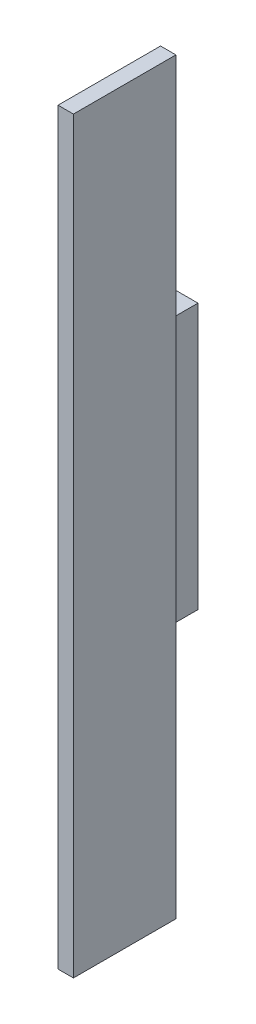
ISO-10303-21;
HEADER;
FILE_DESCRIPTION(('STEP AP214'),'2;1');
FILE_NAME('part.step','',(''),(''),'','','');
FILE_SCHEMA(('AUTOMOTIVE_DESIGN { 1 0 10303 214 1 1 1 1 }'));
ENDSEC;
DATA;
#1=APPLICATION_CONTEXT('core data for automotive mechanical design processes');
#2=APPLICATION_PROTOCOL_DEFINITION('international standard','automotive_design',2000,#1);
#3=PRODUCT_CONTEXT('',#1,'mechanical');
#4=PRODUCT('Part','Part','',(#3));
#5=PRODUCT_RELATED_PRODUCT_CATEGORY('part','',(#4));
#6=PRODUCT_DEFINITION_FORMATION('','',#4);
#7=PRODUCT_DEFINITION_CONTEXT('part definition',#1,'design');
#8=PRODUCT_DEFINITION('design','',#6,#7);
#9=PRODUCT_DEFINITION_SHAPE('','',#8);
#10=(LENGTH_UNIT() NAMED_UNIT(*) SI_UNIT(.MILLI.,.METRE.));
#11=(NAMED_UNIT(*) PLANE_ANGLE_UNIT() SI_UNIT($,.RADIAN.));
#12=(NAMED_UNIT(*) SI_UNIT($,.STERADIAN.) SOLID_ANGLE_UNIT());
#13=UNCERTAINTY_MEASURE_WITH_UNIT(LENGTH_MEASURE(1.E-05),#10,'distance_accuracy_value','');
#14=(GEOMETRIC_REPRESENTATION_CONTEXT(3) GLOBAL_UNCERTAINTY_ASSIGNED_CONTEXT((#13)) GLOBAL_UNIT_ASSIGNED_CONTEXT((#10,
#11,#12)) REPRESENTATION_CONTEXT('',''));
#15=CARTESIAN_POINT('',(0.,0.,0.));
#16=DIRECTION('',(0.,0.,1.));
#17=DIRECTION('',(1.,0.,0.));
#18=AXIS2_PLACEMENT_3D('',#15,#16,#17);
#19=CARTESIAN_POINT('',(3.,73.,20.));
#20=DIRECTION('',(0.,0.,-1.));
#21=DIRECTION('',(0.,1.,0.));
#22=AXIS2_PLACEMENT_3D('',#19,#20,#21);
#23=PLANE('',#22);
#24=DIRECTION('',(0.,-1.,0.));
#25=VECTOR('',#24,1.);
#26=CARTESIAN_POINT('',(0.,73.,20.));
#27=LINE('',#26,#25);
#28=CARTESIAN_POINT('',(0.,73.,20.));
#29=VERTEX_POINT('',#28);
#30=CARTESIAN_POINT('',(0.,-73.,20.));
#31=VERTEX_POINT('',#30);
#32=EDGE_CURVE('E155',#29,#31,#27,.T.);
#33=ORIENTED_EDGE('',*,*,#32,.T.);
#34=DIRECTION('',(-1.,0.,0.));
#35=VECTOR('',#34,1.);
#36=CARTESIAN_POINT('',(3.,-73.,20.));
#37=LINE('',#36,#35);
#38=CARTESIAN_POINT('',(3.,-73.,20.));
#39=VERTEX_POINT('',#38);
#40=EDGE_CURVE('E9',#39,#31,#37,.T.);
#41=ORIENTED_EDGE('',*,*,#40,.F.);
#42=DIRECTION('',(0.,-1.,0.));
#43=VECTOR('',#42,1.);
#44=CARTESIAN_POINT('',(3.,73.,20.));
#45=LINE('',#44,#43);
#46=CARTESIAN_POINT('',(3.,73.,20.));
#47=VERTEX_POINT('',#46);
#48=EDGE_CURVE('E196',#47,#39,#45,.T.);
#49=ORIENTED_EDGE('',*,*,#48,.F.);
#50=DIRECTION('',(-1.,0.,0.));
#51=VECTOR('',#50,1.);
#52=CARTESIAN_POINT('',(3.,73.,20.));
#53=LINE('',#52,#51);
#54=EDGE_CURVE('E193',#47,#29,#53,.T.);
#55=ORIENTED_EDGE('',*,*,#54,.T.);
#56=EDGE_LOOP('',(#33,#41,#49,#55));
#57=FACE_BOUND('',#56,.T.);
#58=ADVANCED_FACE('F14',(#57),#23,.F.);
#59=CARTESIAN_POINT('',(3.,-73.,20.));
#60=DIRECTION('',(0.,1.,0.));
#61=DIRECTION('',(-1.,0.,0.));
#62=AXIS2_PLACEMENT_3D('',#59,#60,#61);
#63=PLANE('',#62);
#64=DIRECTION('',(0.,0.,-1.));
#65=VECTOR('',#64,1.);
#66=CARTESIAN_POINT('',(0.,-73.,20.));
#67=LINE('',#66,#65);
#68=CARTESIAN_POINT('',(0.,-73.,0.));
#69=VERTEX_POINT('',#68);
#70=EDGE_CURVE('E165',#31,#69,#67,.T.);
#71=ORIENTED_EDGE('',*,*,#70,.T.);
#72=DIRECTION('',(-1.,0.,0.));
#73=VECTOR('',#72,1.);
#74=CARTESIAN_POINT('',(3.,-73.,0.));
#75=LINE('',#74,#73);
#76=CARTESIAN_POINT('',(3.,-73.,0.));
#77=VERTEX_POINT('',#76);
#78=EDGE_CURVE('E23',#77,#69,#75,.T.);
#79=ORIENTED_EDGE('',*,*,#78,.F.);
#80=DIRECTION('',(0.,0.,-1.));
#81=VECTOR('',#80,1.);
#82=CARTESIAN_POINT('',(3.,-73.,20.));
#83=LINE('',#82,#81);
#84=EDGE_CURVE('E197',#39,#77,#83,.T.);
#85=ORIENTED_EDGE('',*,*,#84,.F.);
#86=ORIENTED_EDGE('',*,*,#40,.T.);
#87=EDGE_LOOP('',(#71,#79,#85,#86));
#88=FACE_BOUND('',#87,.T.);
#89=ADVANCED_FACE('F208',(#88),#63,.F.);
#90=CARTESIAN_POINT('',(3.,-73.,0.));
#91=DIRECTION('',(0.,0.,1.));
#92=DIRECTION('',(1.,0.,0.));
#93=AXIS2_PLACEMENT_3D('',#90,#91,#92);
#94=PLANE('',#93);
#95=DIRECTION('',(0.,1.,0.));
#96=VECTOR('',#95,1.);
#97=CARTESIAN_POINT('',(0.,-73.,0.));
#98=LINE('',#97,#96);
#99=CARTESIAN_POINT('',(0.,-35.,0.));
#100=VERTEX_POINT('',#99);
#101=EDGE_CURVE('E178',#69,#100,#98,.T.);
#102=ORIENTED_EDGE('',*,*,#101,.T.);
#103=DIRECTION('',(1.,0.,0.));
#104=VECTOR('',#103,1.);
#105=CARTESIAN_POINT('',(-6.,-35.,0.));
#106=LINE('',#105,#104);
#107=CARTESIAN_POINT('',(-6.,-35.,0.));
#108=VERTEX_POINT('',#107);
#109=EDGE_CURVE('E112',#108,#100,#106,.T.);
#110=ORIENTED_EDGE('',*,*,#109,.F.);
#111=DIRECTION('',(0.,1.,0.));
#112=VECTOR('',#111,1.);
#113=CARTESIAN_POINT('',(-6.,-35.,0.));
#114=LINE('',#113,#112);
#115=CARTESIAN_POINT('',(-6.,-25.9,0.));
#116=VERTEX_POINT('',#115);
#117=EDGE_CURVE('E136',#108,#116,#114,.T.);
#118=ORIENTED_EDGE('',*,*,#117,.T.);
#119=DIRECTION('',(1.,0.,0.));
#120=VECTOR('',#119,1.);
#121=CARTESIAN_POINT('',(-6.,-25.9,0.));
#122=LINE('',#121,#120);
#123=CARTESIAN_POINT('',(0.,-25.9,0.));
#124=VERTEX_POINT('',#123);
#125=EDGE_CURVE('E161',#116,#124,#122,.T.);
#126=ORIENTED_EDGE('',*,*,#125,.T.);
#127=CARTESIAN_POINT('',(0.,25.9,0.));
#128=VERTEX_POINT('',#127);
#129=EDGE_CURVE('E179',#124,#128,#98,.T.);
#130=ORIENTED_EDGE('',*,*,#129,.T.);
#131=DIRECTION('',(1.,0.,0.));
#132=VECTOR('',#131,1.);
#133=CARTESIAN_POINT('',(-6.,25.9,0.));
#134=LINE('',#133,#132);
#135=CARTESIAN_POINT('',(-6.,25.9,0.));
#136=VERTEX_POINT('',#135);
#137=EDGE_CURVE('E159',#136,#128,#134,.T.);
#138=ORIENTED_EDGE('',*,*,#137,.F.);
#139=DIRECTION('',(0.,1.,0.));
#140=VECTOR('',#139,1.);
#141=CARTESIAN_POINT('',(-6.,25.9,0.));
#142=LINE('',#141,#140);
#143=CARTESIAN_POINT('',(-6.,34.9999999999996,0.));
#144=VERTEX_POINT('',#143);
#145=EDGE_CURVE('E148',#136,#144,#142,.T.);
#146=ORIENTED_EDGE('',*,*,#145,.T.);
#147=DIRECTION('',(1.,0.,0.));
#148=VECTOR('',#147,1.);
#149=CARTESIAN_POINT('',(-6.,34.9999999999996,0.));
#150=LINE('',#149,#148);
#151=CARTESIAN_POINT('',(0.,34.9999999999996,0.));
#152=VERTEX_POINT('',#151);
#153=EDGE_CURVE('E156',#144,#152,#150,.T.);
#154=ORIENTED_EDGE('',*,*,#153,.T.);
#155=CARTESIAN_POINT('',(0.,73.,0.));
#156=VERTEX_POINT('',#155);
#157=EDGE_CURVE('E167',#152,#156,#98,.T.);
#158=ORIENTED_EDGE('',*,*,#157,.T.);
#159=DIRECTION('',(-1.,0.,0.));
#160=VECTOR('',#159,1.);
#161=CARTESIAN_POINT('',(3.,73.,0.));
#162=LINE('',#161,#160);
#163=CARTESIAN_POINT('',(3.,73.,0.));
#164=VERTEX_POINT('',#163);
#165=EDGE_CURVE('E188',#164,#156,#162,.T.);
#166=ORIENTED_EDGE('',*,*,#165,.F.);
#167=DIRECTION('',(0.,1.,0.));
#168=VECTOR('',#167,1.);
#169=CARTESIAN_POINT('',(3.,-73.,0.));
#170=LINE('',#169,#168);
#171=EDGE_CURVE('E200',#77,#164,#170,.T.);
#172=ORIENTED_EDGE('',*,*,#171,.F.);
#173=ORIENTED_EDGE('',*,*,#78,.T.);
#174=EDGE_LOOP('',(#102,#110,#118,#126,#130,#138,#146,#154,#158,#166,#172,#173));
#175=FACE_BOUND('',#174,.T.);
#176=ADVANCED_FACE('F186',(#175),#94,.F.);
#177=CARTESIAN_POINT('',(3.,73.,0.));
#178=DIRECTION('',(0.,-1.,0.));
#179=DIRECTION('',(1.,0.,0.));
#180=AXIS2_PLACEMENT_3D('',#177,#178,#179);
#181=PLANE('',#180);
#182=DIRECTION('',(0.,0.,1.));
#183=VECTOR('',#182,1.);
#184=CARTESIAN_POINT('',(0.,73.,0.));
#185=LINE('',#184,#183);
#186=EDGE_CURVE('E170',#156,#29,#185,.T.);
#187=ORIENTED_EDGE('',*,*,#186,.T.);
#188=ORIENTED_EDGE('',*,*,#54,.F.);
#189=DIRECTION('',(0.,0.,1.));
#190=VECTOR('',#189,1.);
#191=CARTESIAN_POINT('',(3.,73.,0.));
#192=LINE('',#191,#190);
#193=EDGE_CURVE('E39',#164,#47,#192,.T.);
#194=ORIENTED_EDGE('',*,*,#193,.F.);
#195=ORIENTED_EDGE('',*,*,#165,.T.);
#196=EDGE_LOOP('',(#187,#188,#194,#195));
#197=FACE_BOUND('',#196,.T.);
#198=ADVANCED_FACE('F191',(#197),#181,.F.);
#199=CARTESIAN_POINT('',(3.,-73.,20.));
#200=DIRECTION('',(1.,0.,0.));
#201=DIRECTION('',(0.,1.,0.));
#202=AXIS2_PLACEMENT_3D('',#199,#200,#201);
#203=PLANE('',#202);
#204=ORIENTED_EDGE('',*,*,#48,.T.);
#205=ORIENTED_EDGE('',*,*,#84,.T.);
#206=ORIENTED_EDGE('',*,*,#171,.T.);
#207=ORIENTED_EDGE('',*,*,#193,.T.);
#208=EDGE_LOOP('',(#204,#205,#206,#207));
#209=FACE_BOUND('',#208,.T.);
#210=ADVANCED_FACE('F224',(#209),#203,.T.);
#211=CARTESIAN_POINT('',(0.,-73.,20.));
#212=DIRECTION('',(1.,0.,0.));
#213=DIRECTION('',(0.,1.,0.));
#214=AXIS2_PLACEMENT_3D('',#211,#212,#213);
#215=PLANE('',#214);
#216=DIRECTION('',(0.,-1.,0.));
#217=VECTOR('',#216,1.);
#218=CARTESIAN_POINT('',(0.,-35.,7.69999999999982));
#219=LINE('',#218,#217);
#220=CARTESIAN_POINT('',(0.,35.,7.69999999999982));
#221=VERTEX_POINT('',#220);
#222=CARTESIAN_POINT('',(0.,-35.,7.69999999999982));
#223=VERTEX_POINT('',#222);
#224=EDGE_CURVE('E31',#221,#223,#219,.T.);
#225=ORIENTED_EDGE('',*,*,#224,.T.);
#226=DIRECTION('',(0.,0.,-1.));
#227=VECTOR('',#226,1.);
#228=CARTESIAN_POINT('',(0.,-35.,0.));
#229=LINE('',#228,#227);
#230=EDGE_CURVE('E17',#223,#100,#229,.T.);
#231=ORIENTED_EDGE('',*,*,#230,.T.);
#232=ORIENTED_EDGE('',*,*,#101,.F.);
#233=ORIENTED_EDGE('',*,*,#70,.F.);
#234=ORIENTED_EDGE('',*,*,#32,.F.);
#235=ORIENTED_EDGE('',*,*,#186,.F.);
#236=ORIENTED_EDGE('',*,*,#157,.F.);
#237=DIRECTION('',(0.,0.,1.));
#238=VECTOR('',#237,1.);
#239=CARTESIAN_POINT('',(0.,35.,7.69999999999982));
#240=LINE('',#239,#238);
#241=EDGE_CURVE('E125',#152,#221,#240,.T.);
#242=ORIENTED_EDGE('',*,*,#241,.T.);
#243=EDGE_LOOP('',(#225,#231,#232,#233,#234,#235,#236,#242));
#244=FACE_BOUND('',#243,.T.);
#245=ADVANCED_FACE('F122',(#244),#215,.F.);
#246=CARTESIAN_POINT('',(0.,25.9,7.69999999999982));
#247=DIRECTION('',(1.,0.,0.));
#248=DIRECTION('',(0.,1.,0.));
#249=AXIS2_PLACEMENT_3D('',#246,#247,#248);
#250=PLANE('',#249);
#251=ORIENTED_EDGE('',*,*,#129,.F.);
#252=DIRECTION('',(0.,0.,-1.));
#253=VECTOR('',#252,1.);
#254=CARTESIAN_POINT('',(0.,-25.9,0.));
#255=LINE('',#254,#253);
#256=CARTESIAN_POINT('',(0.,-25.9,-7.30000000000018));
#257=VERTEX_POINT('',#256);
#258=EDGE_CURVE('E120',#124,#257,#255,.T.);
#259=ORIENTED_EDGE('',*,*,#258,.T.);
#260=DIRECTION('',(0.,1.,0.));
#261=VECTOR('',#260,1.);
#262=CARTESIAN_POINT('',(0.,-25.9,-7.30000000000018));
#263=LINE('',#262,#261);
#264=CARTESIAN_POINT('',(0.,25.9,-7.30000000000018));
#265=VERTEX_POINT('',#264);
#266=EDGE_CURVE('E129',#257,#265,#263,.T.);
#267=ORIENTED_EDGE('',*,*,#266,.T.);
#268=DIRECTION('',(0.,0.,1.));
#269=VECTOR('',#268,1.);
#270=CARTESIAN_POINT('',(0.,25.9,-7.30000000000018));
#271=LINE('',#270,#269);
#272=EDGE_CURVE('E132',#265,#128,#271,.T.);
#273=ORIENTED_EDGE('',*,*,#272,.T.);
#274=EDGE_LOOP('',(#251,#259,#267,#273));
#275=FACE_BOUND('',#274,.T.);
#276=ADVANCED_FACE('F229',(#275),#250,.T.);
#277=CARTESIAN_POINT('',(-6.,-35.,7.69999999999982));
#278=DIRECTION('',(0.,0.,1.));
#279=DIRECTION('',(1.,0.,0.));
#280=AXIS2_PLACEMENT_3D('',#277,#278,#279);
#281=PLANE('',#280);
#282=ORIENTED_EDGE('',*,*,#224,.F.);
#283=DIRECTION('',(1.,0.,0.));
#284=VECTOR('',#283,1.);
#285=CARTESIAN_POINT('',(-6.,35.,7.69999999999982));
#286=LINE('',#285,#284);
#287=CARTESIAN_POINT('',(-6.,35.,7.69999999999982));
#288=VERTEX_POINT('',#287);
#289=EDGE_CURVE('E153',#288,#221,#286,.T.);
#290=ORIENTED_EDGE('',*,*,#289,.F.);
#291=DIRECTION('',(0.,-1.,0.));
#292=VECTOR('',#291,1.);
#293=CARTESIAN_POINT('',(-6.,-35.,7.69999999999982));
#294=LINE('',#293,#292);
#295=CARTESIAN_POINT('',(-6.,-35.,7.69999999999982));
#296=VERTEX_POINT('',#295);
#297=EDGE_CURVE('E108',#288,#296,#294,.T.);
#298=ORIENTED_EDGE('',*,*,#297,.T.);
#299=DIRECTION('',(1.,0.,0.));
#300=VECTOR('',#299,1.);
#301=CARTESIAN_POINT('',(-6.,-35.,7.69999999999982));
#302=LINE('',#301,#300);
#303=EDGE_CURVE('E104',#296,#223,#302,.T.);
#304=ORIENTED_EDGE('',*,*,#303,.T.);
#305=EDGE_LOOP('',(#282,#290,#298,#304));
#306=FACE_BOUND('',#305,.T.);
#307=ADVANCED_FACE('F106',(#306),#281,.T.);
#308=CARTESIAN_POINT('',(-6.,35.,7.69999999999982));
#309=DIRECTION('',(0.,1.,0.));
#310=DIRECTION('',(0.,0.,1.));
#311=AXIS2_PLACEMENT_3D('',#308,#309,#310);
#312=PLANE('',#311);
#313=ORIENTED_EDGE('',*,*,#241,.F.);
#314=ORIENTED_EDGE('',*,*,#153,.F.);
#315=DIRECTION('',(0.,0.,1.));
#316=VECTOR('',#315,1.);
#317=CARTESIAN_POINT('',(-6.,35.,7.69999999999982));
#318=LINE('',#317,#316);
#319=EDGE_CURVE('E113',#144,#288,#318,.T.);
#320=ORIENTED_EDGE('',*,*,#319,.T.);
#321=ORIENTED_EDGE('',*,*,#289,.T.);
#322=EDGE_LOOP('',(#313,#314,#320,#321));
#323=FACE_BOUND('',#322,.T.);
#324=ADVANCED_FACE('F232',(#323),#312,.T.);
#325=CARTESIAN_POINT('',(-6.,25.9,-7.30000000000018));
#326=DIRECTION('',(0.,1.,0.));
#327=DIRECTION('',(-1.,0.,0.));
#328=AXIS2_PLACEMENT_3D('',#325,#326,#327);
#329=PLANE('',#328);
#330=ORIENTED_EDGE('',*,*,#272,.F.);
#331=DIRECTION('',(1.,0.,0.));
#332=VECTOR('',#331,1.);
#333=CARTESIAN_POINT('',(-6.,25.9,-7.30000000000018));
#334=LINE('',#333,#332);
#335=CARTESIAN_POINT('',(-6.,25.9,-7.30000000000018));
#336=VERTEX_POINT('',#335);
#337=EDGE_CURVE('E157',#336,#265,#334,.T.);
#338=ORIENTED_EDGE('',*,*,#337,.F.);
#339=DIRECTION('',(0.,0.,1.));
#340=VECTOR('',#339,1.);
#341=CARTESIAN_POINT('',(-6.,25.9,-7.30000000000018));
#342=LINE('',#341,#340);
#343=EDGE_CURVE('E145',#336,#136,#342,.T.);
#344=ORIENTED_EDGE('',*,*,#343,.T.);
#345=ORIENTED_EDGE('',*,*,#137,.T.);
#346=EDGE_LOOP('',(#330,#338,#344,#345));
#347=FACE_BOUND('',#346,.T.);
#348=ADVANCED_FACE('F243',(#347),#329,.T.);
#349=CARTESIAN_POINT('',(-6.,-25.9,-7.30000000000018));
#350=DIRECTION('',(0.,0.,-1.));
#351=DIRECTION('',(-1.,0.,0.));
#352=AXIS2_PLACEMENT_3D('',#349,#350,#351);
#353=PLANE('',#352);
#354=ORIENTED_EDGE('',*,*,#266,.F.);
#355=DIRECTION('',(1.,0.,0.));
#356=VECTOR('',#355,1.);
#357=CARTESIAN_POINT('',(-6.,-25.9,-7.30000000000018));
#358=LINE('',#357,#356);
#359=CARTESIAN_POINT('',(-6.,-25.9,-7.30000000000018));
#360=VERTEX_POINT('',#359);
#361=EDGE_CURVE('E160',#360,#257,#358,.T.);
#362=ORIENTED_EDGE('',*,*,#361,.F.);
#363=DIRECTION('',(0.,1.,0.));
#364=VECTOR('',#363,1.);
#365=CARTESIAN_POINT('',(-6.,-25.9,-7.30000000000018));
#366=LINE('',#365,#364);
#367=EDGE_CURVE('E142',#360,#336,#366,.T.);
#368=ORIENTED_EDGE('',*,*,#367,.T.);
#369=ORIENTED_EDGE('',*,*,#337,.T.);
#370=EDGE_LOOP('',(#354,#362,#368,#369));
#371=FACE_BOUND('',#370,.T.);
#372=ADVANCED_FACE('F239',(#371),#353,.T.);
#373=CARTESIAN_POINT('',(-6.,-25.9,0.));
#374=DIRECTION('',(0.,-1.,0.));
#375=DIRECTION('',(1.,0.,0.));
#376=AXIS2_PLACEMENT_3D('',#373,#374,#375);
#377=PLANE('',#376);
#378=ORIENTED_EDGE('',*,*,#258,.F.);
#379=ORIENTED_EDGE('',*,*,#125,.F.);
#380=DIRECTION('',(0.,0.,-1.));
#381=VECTOR('',#380,1.);
#382=CARTESIAN_POINT('',(-6.,-25.9,0.));
#383=LINE('',#382,#381);
#384=EDGE_CURVE('E139',#116,#360,#383,.T.);
#385=ORIENTED_EDGE('',*,*,#384,.T.);
#386=ORIENTED_EDGE('',*,*,#361,.T.);
#387=EDGE_LOOP('',(#378,#379,#385,#386));
#388=FACE_BOUND('',#387,.T.);
#389=ADVANCED_FACE('F236',(#388),#377,.T.);
#390=CARTESIAN_POINT('',(-6.,-35.,0.));
#391=DIRECTION('',(0.,-1.,0.));
#392=DIRECTION('',(1.,0.,0.));
#393=AXIS2_PLACEMENT_3D('',#390,#391,#392);
#394=PLANE('',#393);
#395=ORIENTED_EDGE('',*,*,#230,.F.);
#396=ORIENTED_EDGE('',*,*,#303,.F.);
#397=DIRECTION('',(0.,0.,-1.));
#398=VECTOR('',#397,1.);
#399=CARTESIAN_POINT('',(-6.,-35.,0.));
#400=LINE('',#399,#398);
#401=EDGE_CURVE('E134',#296,#108,#400,.T.);
#402=ORIENTED_EDGE('',*,*,#401,.T.);
#403=ORIENTED_EDGE('',*,*,#109,.T.);
#404=EDGE_LOOP('',(#395,#396,#402,#403));
#405=FACE_BOUND('',#404,.T.);
#406=ADVANCED_FACE('F116',(#405),#394,.T.);
#407=CARTESIAN_POINT('',(-6.,25.9,7.69999999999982));
#408=DIRECTION('',(1.,0.,0.));
#409=DIRECTION('',(0.,1.,0.));
#410=AXIS2_PLACEMENT_3D('',#407,#408,#409);
#411=PLANE('',#410);
#412=ORIENTED_EDGE('',*,*,#297,.F.);
#413=ORIENTED_EDGE('',*,*,#319,.F.);
#414=ORIENTED_EDGE('',*,*,#145,.F.);
#415=ORIENTED_EDGE('',*,*,#343,.F.);
#416=ORIENTED_EDGE('',*,*,#367,.F.);
#417=ORIENTED_EDGE('',*,*,#384,.F.);
#418=ORIENTED_EDGE('',*,*,#117,.F.);
#419=ORIENTED_EDGE('',*,*,#401,.F.);
#420=EDGE_LOOP('',(#412,#413,#414,#415,#416,#417,#418,#419));
#421=FACE_BOUND('',#420,.T.);
#422=ADVANCED_FACE('F235',(#421),#411,.F.);
#423=CLOSED_SHELL('',(#58,#89,#176,#198,#210,#245,#276,#307,#324,#348,#372,#389,#406,#422));
#424=MANIFOLD_SOLID_BREP('B1',#423);
#425=ADVANCED_BREP_SHAPE_REPRESENTATION('',(#18,#424),#14);
#426=SHAPE_DEFINITION_REPRESENTATION(#9,#425);
ENDSEC;
END-ISO-10303-21;
